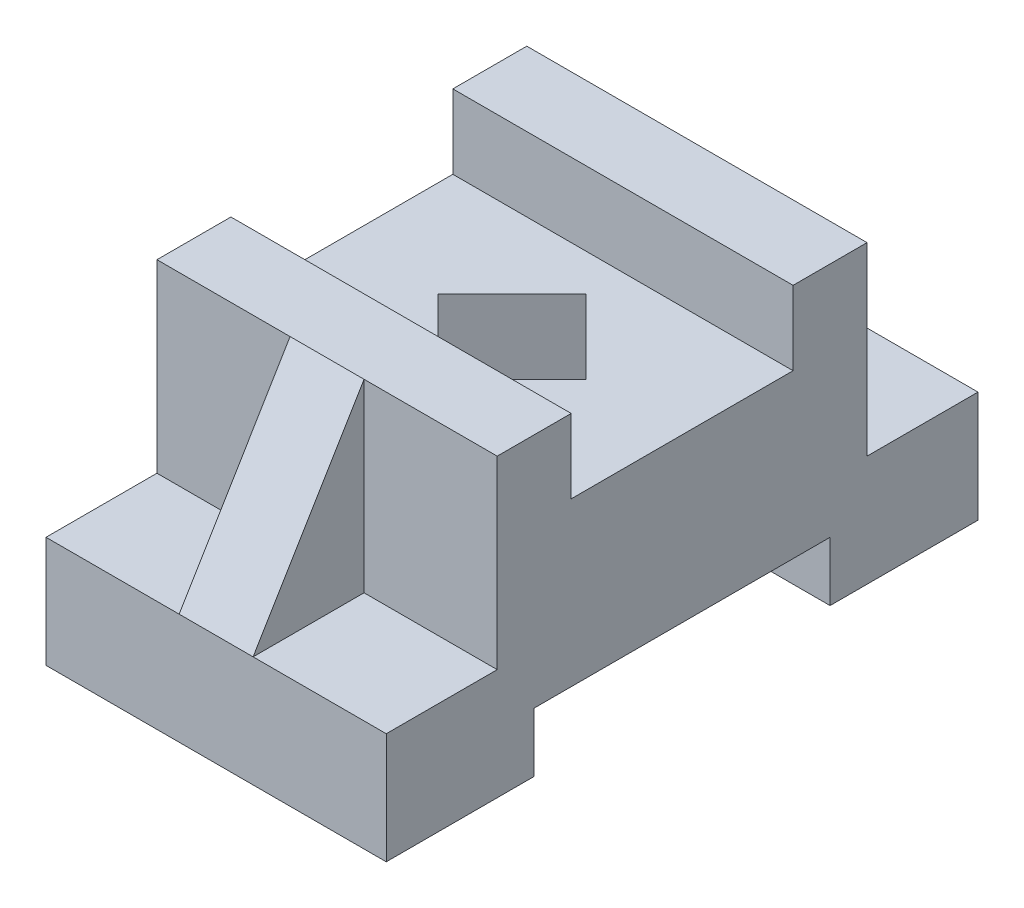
from build123d import *

# Parameters (mm, degrees)
BOSS_EXTRUDE2_DEPTH      = 10
BOSS_EXTRUDE2_DEPTH_BACK = 30
SKETCH3_W                = 46
SKETCH3_H                = 10
SKETCH3_W_2              = 18
SKETCH3_H_2              = 15
SKETCH3_W_3              = 10
SKETCH3_H_3              = 30
SKETCH3_11_W             = 46
SKETCH3_11_H             = 30
SKETCH3_11_W_2           = 18
SKETCH3_11_H_2           = 15
CUT_EXTRUDE6_DEPTH       = 10
SKETCH3_12_W             = 18
SKETCH3_12_H             = 15
CUT_EXTRUDE7_DEPTH       = 15
CUT_EXTRUDE8_DEPTH       = 15
SKETCH9_W                = 46
SKETCH9_H                = 40
CUT_EXTRUDE9_DEPTH       = 8


with BuildPart() as part:
    # Sketch3 → Boss-Extrude2 (new, two sides: drawn at the far end of the back side and taken through both)
    # profile 1 of 9: a face of its own
    with BuildSketch(Plane(origin=(0, 0, 0), x_dir=(1, 0, 0), z_dir=(0, 1, 0)).offset(-BOSS_EXTRUDE2_DEPTH_BACK)):
        with Locations((0, -20)):
            Rectangle(SKETCH3_W, SKETCH3_H)
    # profile 2 of 9: a face of its own
    with BuildSketch(Plane(origin=(0, 0, 0), x_dir=(1, 0, 0), z_dir=(0, 1, 0)).offset(-BOSS_EXTRUDE2_DEPTH_BACK)):
        with Locations((14, -32.5)):
            Rectangle(SKETCH3_W_2, SKETCH3_H_2)
    # profile 3 of 9: a face of its own
    with BuildSketch(Plane(origin=(0, 0, 0), x_dir=(1, 0, 0), z_dir=(0, 1, 0)).offset(-BOSS_EXTRUDE2_DEPTH_BACK)):
        with Locations((-14, -32.5)):
            Rectangle(SKETCH3_W_2, SKETCH3_H_2)
    # profile 4 of 9: a face of its own
    with BuildSketch(Plane(origin=(0, 0, 0), x_dir=(1, 0, 0), z_dir=(0, 1, 0)).offset(-BOSS_EXTRUDE2_DEPTH_BACK)):
        with Locations((0, -32.5)):
            Rectangle(SKETCH3_W_3, SKETCH3_H_2)
    # profile 5 of 9: a face of its own
    with BuildSketch(Plane(origin=(0, 0, 0), x_dir=(1, 0, 0), z_dir=(0, 1, 0)).offset(-BOSS_EXTRUDE2_DEPTH_BACK)):
        Rectangle(SKETCH3_W, SKETCH3_H_3)
        Polygon((10, 0), (0, 10), (-10, 0), (0, -10), align=None, mode=Mode.SUBTRACT)
    # profile 6 of 9: a face of its own
    with BuildSketch(Plane(origin=(0, 0, 0), x_dir=(1, 0, 0), z_dir=(0, 1, 0)).offset(-BOSS_EXTRUDE2_DEPTH_BACK)):
        with Locations((-14, 32.5)):
            Rectangle(SKETCH3_W_2, SKETCH3_H_2)
    # profile 7 of 9: a face of its own
    with BuildSketch(Plane(origin=(0, 0, 0), x_dir=(1, 0, 0), z_dir=(0, 1, 0)).offset(-BOSS_EXTRUDE2_DEPTH_BACK)):
        with Locations((0, 32.5)):
            Rectangle(SKETCH3_W_3, SKETCH3_H_2)
    # profile 8 of 9: a face of its own
    with BuildSketch(Plane(origin=(0, 0, 0), x_dir=(1, 0, 0), z_dir=(0, 1, 0)).offset(-BOSS_EXTRUDE2_DEPTH_BACK)):
        with Locations((14, 32.5)):
            Rectangle(SKETCH3_W_2, SKETCH3_H_2)
    # profile 9 of 9: a face of its own
    with BuildSketch(Plane(origin=(0, 0, 0), x_dir=(1, 0, 0), z_dir=(0, 1, 0)).offset(-BOSS_EXTRUDE2_DEPTH_BACK)):
        with Locations((0, 20)):
            Rectangle(SKETCH3_W, SKETCH3_H)
    extrude(amount=BOSS_EXTRUDE2_DEPTH + BOSS_EXTRUDE2_DEPTH_BACK)

    # Sketch3_11 → Cut-Extrude6 (cut)
    # profile 1 of 5: a face of its own
    with BuildSketch(Plane(origin=(0, 0, 0), x_dir=(1, 0, 0), z_dir=(0, 1, 0))):
        Rectangle(SKETCH3_11_W, SKETCH3_11_H)
        Polygon((10, 0), (0, 10), (-10, 0), (0, -10), align=None, mode=Mode.SUBTRACT)
    # profile 2 of 5: a face of its own
    with BuildSketch(Plane(origin=(0, 0, 0), x_dir=(1, 0, 0), z_dir=(0, 1, 0))):
        with Locations((-14, -32.5)):
            Rectangle(SKETCH3_11_W_2, SKETCH3_11_H_2)
    # profile 3 of 5: a face of its own
    with BuildSketch(Plane(origin=(0, 0, 0), x_dir=(1, 0, 0), z_dir=(0, 1, 0))):
        with Locations((14, -32.5)):
            Rectangle(SKETCH3_11_W_2, SKETCH3_11_H_2)
    # profile 4 of 5: a face of its own
    with BuildSketch(Plane(origin=(0, 0, 0), x_dir=(1, 0, 0), z_dir=(0, 1, 0))):
        with Locations((-14, 32.5)):
            Rectangle(SKETCH3_11_W_2, SKETCH3_11_H_2)
    # profile 5 of 5: a face of its own
    with BuildSketch(Plane(origin=(0, 0, 0), x_dir=(1, 0, 0), z_dir=(0, 1, 0))):
        with Locations((14, 32.5)):
            Rectangle(SKETCH3_11_W_2, SKETCH3_11_H_2)
    extrude(amount=CUT_EXTRUDE6_DEPTH, mode=Mode.SUBTRACT)

    # Sketch3_12 → Cut-Extrude7 (cut)
    with BuildSketch(Plane(origin=(0, 0, 0), x_dir=(1, 0, 0), z_dir=(0, 1, 0))):
        with Locations((-14, -32.5)):
            Rectangle(SKETCH3_12_W, SKETCH3_12_H)
        with Locations((14, -32.5)):
            Rectangle(SKETCH3_12_W, SKETCH3_12_H)
        with Locations((14, 32.5)):
            Rectangle(SKETCH3_12_W, SKETCH3_12_H)
        with Locations((-14, 32.5)):
            Rectangle(SKETCH3_12_W, SKETCH3_12_H)
    extrude(amount=-CUT_EXTRUDE7_DEPTH, mode=Mode.SUBTRACT)

    # Sketch8 → Cut-Extrude8 (cut)
    with BuildSketch(Plane(origin=(5, 0, 0), x_dir=(0, 0, -1), z_dir=(1, 0, 0))):
        Polygon((40, -15), (40, 10), (25, 10), align=None)
        Polygon((-40, 10), (-40, -15), (-25, 10), align=None)
    extrude(amount=-CUT_EXTRUDE8_DEPTH, mode=Mode.SUBTRACT)

    # Sketch9 → Cut-Extrude9 (cut)
    with BuildSketch(Plane.XZ.offset(30)):
        Rectangle(SKETCH9_W, SKETCH9_H)
        Polygon((0, 10), (10, 0), (0, -10), (-10, 0), align=None, mode=Mode.SUBTRACT)
    extrude(amount=-CUT_EXTRUDE9_DEPTH, mode=Mode.SUBTRACT)


solid = part.part
